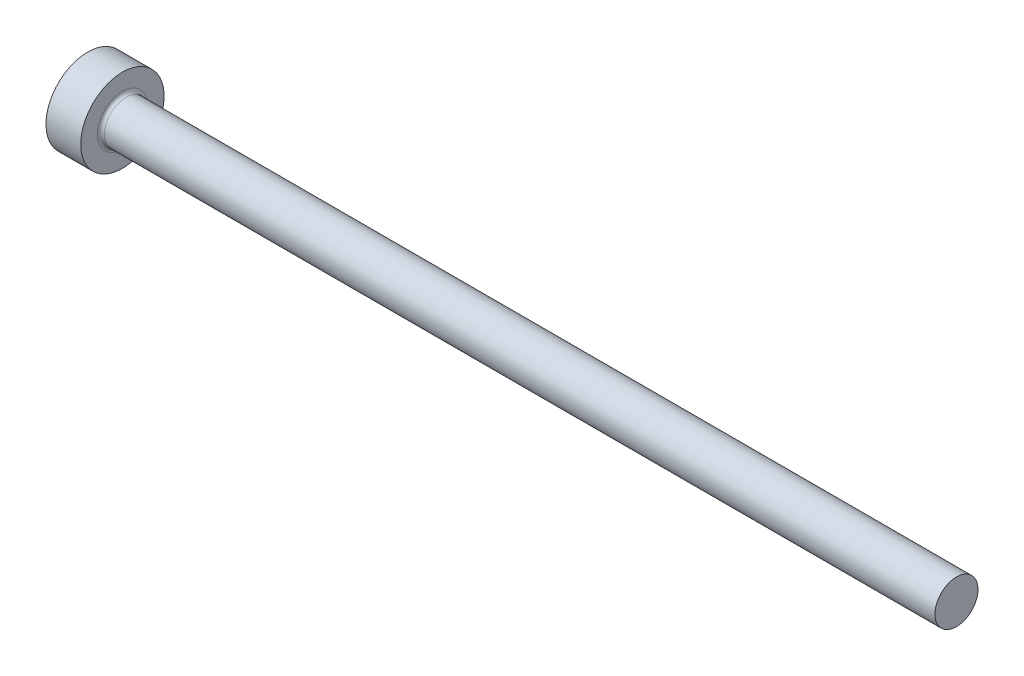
ISO-10303-21;
HEADER;
FILE_DESCRIPTION(('STEP AP214'),'2;1');
FILE_NAME('part.step','',(''),(''),'','','');
FILE_SCHEMA(('AUTOMOTIVE_DESIGN { 1 0 10303 214 1 1 1 1 }'));
ENDSEC;
DATA;
#1=APPLICATION_CONTEXT('core data for automotive mechanical design processes');
#2=APPLICATION_PROTOCOL_DEFINITION('international standard','automotive_design',2000,#1);
#3=PRODUCT_CONTEXT('',#1,'mechanical');
#4=PRODUCT('Part','Part','',(#3));
#5=PRODUCT_RELATED_PRODUCT_CATEGORY('part','',(#4));
#6=PRODUCT_DEFINITION_FORMATION('','',#4);
#7=PRODUCT_DEFINITION_CONTEXT('part definition',#1,'design');
#8=PRODUCT_DEFINITION('design','',#6,#7);
#9=PRODUCT_DEFINITION_SHAPE('','',#8);
#10=(LENGTH_UNIT() NAMED_UNIT(*) SI_UNIT(.MILLI.,.METRE.));
#11=(NAMED_UNIT(*) PLANE_ANGLE_UNIT() SI_UNIT($,.RADIAN.));
#12=(NAMED_UNIT(*) SI_UNIT($,.STERADIAN.) SOLID_ANGLE_UNIT());
#13=UNCERTAINTY_MEASURE_WITH_UNIT(LENGTH_MEASURE(1.E-05),#10,'distance_accuracy_value','');
#14=(GEOMETRIC_REPRESENTATION_CONTEXT(3) GLOBAL_UNCERTAINTY_ASSIGNED_CONTEXT((#13)) GLOBAL_UNIT_ASSIGNED_CONTEXT((#10,
#11,#12)) REPRESENTATION_CONTEXT('',''));
#15=CARTESIAN_POINT('',(0.,0.,0.));
#16=DIRECTION('',(0.,0.,1.));
#17=DIRECTION('',(1.,0.,0.));
#18=AXIS2_PLACEMENT_3D('',#15,#16,#17);
#19=CARTESIAN_POINT('',(0.,0.,0.));
#20=DIRECTION('',(-1.,0.,0.));
#21=DIRECTION('',(0.,-1.,0.));
#22=AXIS2_PLACEMENT_3D('',#19,#20,#21);
#23=PLANE('',#22);
#24=CARTESIAN_POINT('',(0.,0.,0.));
#25=DIRECTION('',(1.,0.,0.));
#26=DIRECTION('',(0.,1.,0.));
#27=AXIS2_PLACEMENT_3D('',#24,#25,#26);
#28=CIRCLE('',#27,6.);
#29=CARTESIAN_POINT('',(0.,6.,0.));
#30=VERTEX_POINT('',#29);
#31=EDGE_CURVE('E25',#30,#30,#28,.T.);
#32=ORIENTED_EDGE('',*,*,#31,.F.);
#33=EDGE_LOOP('',(#32));
#34=FACE_BOUND('',#33,.T.);
#35=ADVANCED_FACE('F14',(#34),#23,.T.);
#36=CARTESIAN_POINT('',(125.,0.,0.));
#37=DIRECTION('',(1.,0.,0.));
#38=DIRECTION('',(0.,1.,0.));
#39=AXIS2_PLACEMENT_3D('',#36,#37,#38);
#40=CYLINDRICAL_SURFACE('',#39,6.);
#41=ORIENTED_EDGE('',*,*,#31,.T.);
#42=EDGE_LOOP('',(#41));
#43=FACE_BOUND('',#42,.T.);
#44=CARTESIAN_POINT('',(5.,0.,0.));
#45=DIRECTION('',(1.,0.,0.));
#46=DIRECTION('',(0.,1.,0.));
#47=AXIS2_PLACEMENT_3D('',#44,#45,#46);
#48=CIRCLE('',#47,6.);
#49=CARTESIAN_POINT('',(5.,6.,0.));
#50=VERTEX_POINT('',#49);
#51=EDGE_CURVE('E29',#50,#50,#48,.T.);
#52=ORIENTED_EDGE('',*,*,#51,.F.);
#53=EDGE_LOOP('',(#52));
#54=FACE_BOUND('',#53,.T.);
#55=ADVANCED_FACE('F51',(#43,#54),#40,.T.);
#56=CARTESIAN_POINT('',(5.,6.,0.));
#57=DIRECTION('',(1.,0.,0.));
#58=DIRECTION('',(0.,1.,0.));
#59=AXIS2_PLACEMENT_3D('',#56,#57,#58);
#60=PLANE('',#59);
#61=CARTESIAN_POINT('',(5.,0.,0.));
#62=DIRECTION('',(1.,0.,0.));
#63=DIRECTION('',(0.,1.,0.));
#64=AXIS2_PLACEMENT_3D('',#61,#62,#63);
#65=CIRCLE('',#64,3.59999999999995);
#66=CARTESIAN_POINT('',(5.,3.59999999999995,0.));
#67=VERTEX_POINT('',#66);
#68=EDGE_CURVE('E9',#67,#67,#65,.F.);
#69=ORIENTED_EDGE('',*,*,#68,.T.);
#70=EDGE_LOOP('',(#69));
#71=FACE_BOUND('',#70,.T.);
#72=ORIENTED_EDGE('',*,*,#51,.T.);
#73=EDGE_LOOP('',(#72));
#74=FACE_BOUND('',#73,.T.);
#75=ADVANCED_FACE('F42',(#71,#74),#60,.T.);
#76=CARTESIAN_POINT('',(125.,0.,0.));
#77=DIRECTION('',(1.,0.,0.));
#78=DIRECTION('',(0.,1.,0.));
#79=AXIS2_PLACEMENT_3D('',#76,#77,#78);
#80=CYLINDRICAL_SURFACE('',#79,3.09999999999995);
#81=CARTESIAN_POINT('',(5.5,0.,0.));
#82=DIRECTION('',(1.,0.,0.));
#83=DIRECTION('',(0.,1.,0.));
#84=AXIS2_PLACEMENT_3D('',#81,#82,#83);
#85=CIRCLE('',#84,3.09999999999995);
#86=CARTESIAN_POINT('',(5.5,3.09999999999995,0.));
#87=VERTEX_POINT('',#86);
#88=EDGE_CURVE('E21',#87,#87,#85,.T.);
#89=ORIENTED_EDGE('',*,*,#88,.T.);
#90=EDGE_LOOP('',(#89));
#91=FACE_BOUND('',#90,.T.);
#92=CARTESIAN_POINT('',(125.,0.,0.));
#93=DIRECTION('',(1.,0.,0.));
#94=DIRECTION('',(0.,1.,0.));
#95=AXIS2_PLACEMENT_3D('',#92,#93,#94);
#96=CIRCLE('',#95,3.1);
#97=CARTESIAN_POINT('',(125.,3.1,0.));
#98=VERTEX_POINT('',#97);
#99=EDGE_CURVE('E34',#98,#98,#96,.T.);
#100=ORIENTED_EDGE('',*,*,#99,.F.);
#101=EDGE_LOOP('',(#100));
#102=FACE_BOUND('',#101,.T.);
#103=ADVANCED_FACE('F40',(#91,#102),#80,.T.);
#104=CARTESIAN_POINT('',(125.,3.1,0.));
#105=DIRECTION('',(1.,0.,0.));
#106=DIRECTION('',(0.,1.,0.));
#107=AXIS2_PLACEMENT_3D('',#104,#105,#106);
#108=PLANE('',#107);
#109=ORIENTED_EDGE('',*,*,#99,.T.);
#110=EDGE_LOOP('',(#109));
#111=FACE_BOUND('',#110,.T.);
#112=ADVANCED_FACE('F38',(#111),#108,.T.);
#113=CARTESIAN_POINT('',(5.5,0.,0.));
#114=DIRECTION('',(1.,0.,0.));
#115=DIRECTION('',(0.,1.,0.));
#116=AXIS2_PLACEMENT_3D('',#113,#114,#115);
#117=TOROIDAL_SURFACE('',#116,3.59999999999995,0.5);
#118=ORIENTED_EDGE('',*,*,#68,.F.);
#119=EDGE_LOOP('',(#118));
#120=FACE_BOUND('',#119,.T.);
#121=ORIENTED_EDGE('',*,*,#88,.F.);
#122=EDGE_LOOP('',(#121));
#123=FACE_BOUND('',#122,.T.);
#124=ADVANCED_FACE('F16',(#120,#123),#117,.F.);
#125=CLOSED_SHELL('',(#35,#55,#75,#103,#112,#124));
#126=MANIFOLD_SOLID_BREP('B1',#125);
#127=ADVANCED_BREP_SHAPE_REPRESENTATION('',(#18,#126),#14);
#128=SHAPE_DEFINITION_REPRESENTATION(#9,#127);
ENDSEC;
END-ISO-10303-21;
